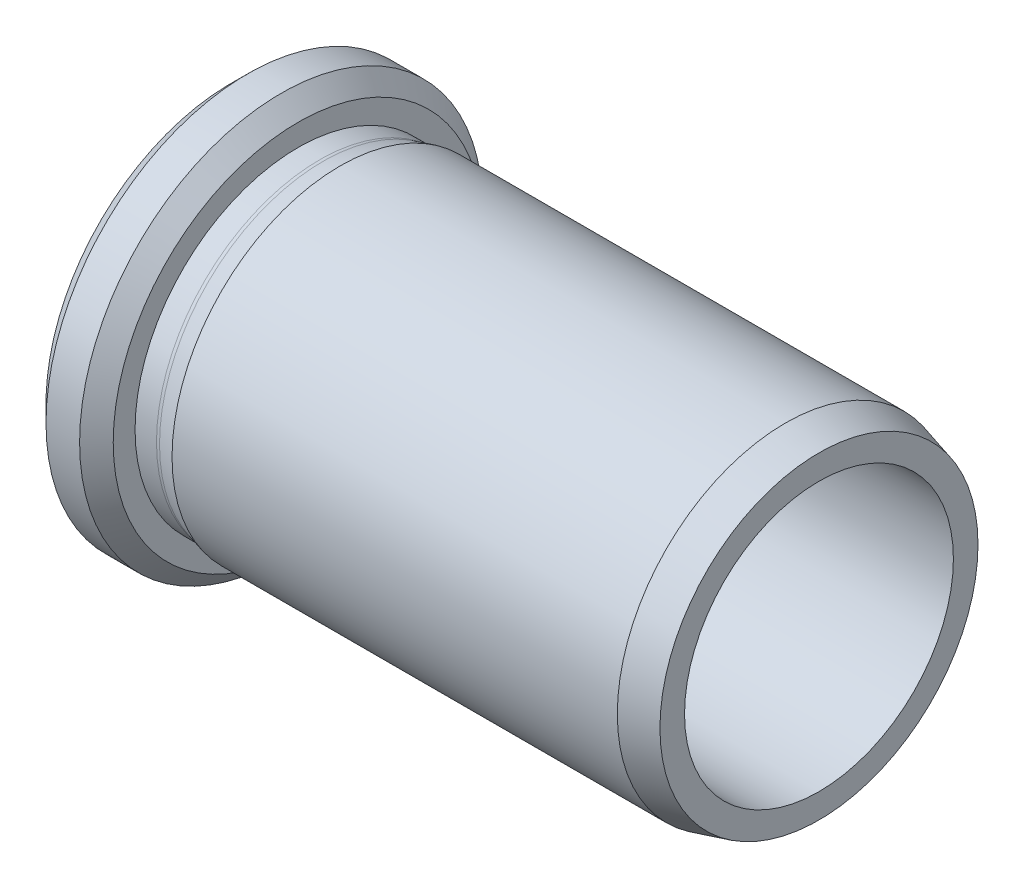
ISO-10303-21;
HEADER;
FILE_DESCRIPTION(('STEP AP214'),'2;1');
FILE_NAME('part.step','',(''),(''),'','','');
FILE_SCHEMA(('AUTOMOTIVE_DESIGN { 1 0 10303 214 1 1 1 1 }'));
ENDSEC;
DATA;
#1=APPLICATION_CONTEXT('core data for automotive mechanical design processes');
#2=APPLICATION_PROTOCOL_DEFINITION('international standard','automotive_design',2000,#1);
#3=PRODUCT_CONTEXT('',#1,'mechanical');
#4=PRODUCT('Part','Part','',(#3));
#5=PRODUCT_RELATED_PRODUCT_CATEGORY('part','',(#4));
#6=PRODUCT_DEFINITION_FORMATION('','',#4);
#7=PRODUCT_DEFINITION_CONTEXT('part definition',#1,'design');
#8=PRODUCT_DEFINITION('design','',#6,#7);
#9=PRODUCT_DEFINITION_SHAPE('','',#8);
#10=(LENGTH_UNIT() NAMED_UNIT(*) SI_UNIT(.MILLI.,.METRE.));
#11=(NAMED_UNIT(*) PLANE_ANGLE_UNIT() SI_UNIT($,.RADIAN.));
#12=(NAMED_UNIT(*) SI_UNIT($,.STERADIAN.) SOLID_ANGLE_UNIT());
#13=UNCERTAINTY_MEASURE_WITH_UNIT(LENGTH_MEASURE(1.E-05),#10,'distance_accuracy_value','');
#14=(GEOMETRIC_REPRESENTATION_CONTEXT(3) GLOBAL_UNCERTAINTY_ASSIGNED_CONTEXT((#13)) GLOBAL_UNIT_ASSIGNED_CONTEXT((#10,
#11,#12)) REPRESENTATION_CONTEXT('',''));
#15=CARTESIAN_POINT('',(0.,0.,0.));
#16=DIRECTION('',(0.,0.,1.));
#17=DIRECTION('',(1.,0.,0.));
#18=AXIS2_PLACEMENT_3D('',#15,#16,#17);
#19=CARTESIAN_POINT('',(16.075539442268,0.,0.));
#20=DIRECTION('',(-1.,0.,0.));
#21=DIRECTION('',(0.,0.,1.));
#22=AXIS2_PLACEMENT_3D('',#19,#20,#21);
#23=TOROIDAL_SURFACE('',#22,10.5,0.8);
#24=CARTESIAN_POINT('',(16.075539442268,0.,0.));
#25=DIRECTION('',(-1.,0.,0.));
#26=DIRECTION('',(0.,0.,1.));
#27=AXIS2_PLACEMENT_3D('',#24,#25,#26);
#28=CIRCLE('',#27,9.7);
#29=CARTESIAN_POINT('',(16.075539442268,0.,9.7));
#30=VERTEX_POINT('',#29);
#31=EDGE_CURVE('E58',#30,#30,#28,.T.);
#32=ORIENTED_EDGE('',*,*,#31,.F.);
#33=EDGE_LOOP('',(#32));
#34=FACE_BOUND('',#33,.T.);
#35=CARTESIAN_POINT('',(16.2825946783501,0.,0.));
#36=DIRECTION('',(-1.,0.,0.));
#37=DIRECTION('',(0.,0.,1.));
#38=AXIS2_PLACEMENT_3D('',#35,#36,#37);
#39=CIRCLE('',#38,9.72725933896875);
#40=CARTESIAN_POINT('',(16.2825946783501,0.,9.72725933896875));
#41=VERTEX_POINT('',#40);
#42=EDGE_CURVE('E40',#41,#41,#39,.T.);
#43=ORIENTED_EDGE('',*,*,#42,.T.);
#44=EDGE_LOOP('',(#43));
#45=FACE_BOUND('',#44,.T.);
#46=ADVANCED_FACE('F14',(#34,#45),#23,.F.);
#47=CARTESIAN_POINT('',(17.3004766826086,0.,0.));
#48=DIRECTION('',(1.,0.,0.));
#49=DIRECTION('',(0.,0.,-1.));
#50=AXIS2_PLACEMENT_3D('',#47,#48,#49);
#51=CONICAL_SURFACE('',#50,10.,0.261799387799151);
#52=ORIENTED_EDGE('',*,*,#42,.F.);
#53=EDGE_LOOP('',(#52));
#54=FACE_BOUND('',#53,.T.);
#55=CARTESIAN_POINT('',(17.3004766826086,0.,0.));
#56=DIRECTION('',(-1.,0.,0.));
#57=DIRECTION('',(0.,0.,1.));
#58=AXIS2_PLACEMENT_3D('',#55,#56,#57);
#59=CIRCLE('',#58,10.);
#60=CARTESIAN_POINT('',(17.3004766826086,0.,10.));
#61=VERTEX_POINT('',#60);
#62=EDGE_CURVE('E43',#61,#61,#59,.T.);
#63=ORIENTED_EDGE('',*,*,#62,.T.);
#64=EDGE_LOOP('',(#63));
#65=FACE_BOUND('',#64,.T.);
#66=ADVANCED_FACE('F66',(#54,#65),#51,.T.);
#67=CARTESIAN_POINT('',(0.,0.,0.));
#68=DIRECTION('',(-1.,0.,0.));
#69=DIRECTION('',(0.,0.,1.));
#70=AXIS2_PLACEMENT_3D('',#67,#68,#69);
#71=CYLINDRICAL_SURFACE('',#70,10.);
#72=ORIENTED_EDGE('',*,*,#62,.F.);
#73=EDGE_LOOP('',(#72));
#74=FACE_BOUND('',#73,.T.);
#75=CARTESIAN_POINT('',(43.8004766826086,0.,0.));
#76=DIRECTION('',(-1.,0.,0.));
#77=DIRECTION('',(0.,0.,1.));
#78=AXIS2_PLACEMENT_3D('',#75,#76,#77);
#79=CIRCLE('',#78,10.);
#80=CARTESIAN_POINT('',(43.8004766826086,0.,10.));
#81=VERTEX_POINT('',#80);
#82=EDGE_CURVE('E46',#81,#81,#79,.T.);
#83=ORIENTED_EDGE('',*,*,#82,.T.);
#84=EDGE_LOOP('',(#83));
#85=FACE_BOUND('',#84,.T.);
#86=ADVANCED_FACE('F72',(#74,#85),#71,.T.);
#87=CARTESIAN_POINT('',(45.8004766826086,0.,0.));
#88=DIRECTION('',(-1.,0.,0.));
#89=DIRECTION('',(0.,0.,1.));
#90=AXIS2_PLACEMENT_3D('',#87,#88,#89);
#91=CONICAL_SURFACE('',#90,9.46410161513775,0.26179938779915);
#92=ORIENTED_EDGE('',*,*,#82,.F.);
#93=EDGE_LOOP('',(#92));
#94=FACE_BOUND('',#93,.T.);
#95=CARTESIAN_POINT('',(45.8004766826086,0.,0.));
#96=DIRECTION('',(-1.,0.,0.));
#97=DIRECTION('',(0.,0.,1.));
#98=AXIS2_PLACEMENT_3D('',#95,#96,#97);
#99=CIRCLE('',#98,9.46410161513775);
#100=CARTESIAN_POINT('',(45.8004766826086,0.,9.46410161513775));
#101=VERTEX_POINT('',#100);
#102=EDGE_CURVE('E49',#101,#101,#99,.T.);
#103=ORIENTED_EDGE('',*,*,#102,.T.);
#104=EDGE_LOOP('',(#103));
#105=FACE_BOUND('',#104,.T.);
#106=ADVANCED_FACE('F78',(#94,#105),#91,.T.);
#107=CARTESIAN_POINT('',(45.8004766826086,9.46410161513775,0.));
#108=DIRECTION('',(-1.,0.,0.));
#109=DIRECTION('',(0.,0.,1.));
#110=AXIS2_PLACEMENT_3D('',#107,#108,#109);
#111=PLANE('',#110);
#112=ORIENTED_EDGE('',*,*,#102,.F.);
#113=EDGE_LOOP('',(#112));
#114=FACE_BOUND('',#113,.T.);
#115=CARTESIAN_POINT('',(45.8004766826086,0.,0.));
#116=DIRECTION('',(-1.,0.,0.));
#117=DIRECTION('',(0.,0.,1.));
#118=AXIS2_PLACEMENT_3D('',#115,#116,#117);
#119=CIRCLE('',#118,8.);
#120=CARTESIAN_POINT('',(45.8004766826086,0.,8.));
#121=VERTEX_POINT('',#120);
#122=EDGE_CURVE('E52',#121,#121,#119,.T.);
#123=ORIENTED_EDGE('',*,*,#122,.T.);
#124=EDGE_LOOP('',(#123));
#125=FACE_BOUND('',#124,.T.);
#126=ADVANCED_FACE('F84',(#114,#125),#111,.F.);
#127=CARTESIAN_POINT('',(0.,0.,0.));
#128=DIRECTION('',(-1.,0.,0.));
#129=DIRECTION('',(0.,0.,1.));
#130=AXIS2_PLACEMENT_3D('',#127,#128,#129);
#131=CYLINDRICAL_SURFACE('',#130,8.);
#132=CARTESIAN_POINT('',(12.3004766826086,0.,0.));
#133=DIRECTION('',(1.,0.,0.));
#134=DIRECTION('',(0.,0.,-1.));
#135=AXIS2_PLACEMENT_3D('',#132,#133,#134);
#136=CIRCLE('',#135,8.);
#137=CARTESIAN_POINT('',(12.3004766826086,0.,-8.));
#138=VERTEX_POINT('',#137);
#139=EDGE_CURVE('E29',#138,#138,#136,.F.);
#140=ORIENTED_EDGE('',*,*,#139,.T.);
#141=EDGE_LOOP('',(#140));
#142=FACE_BOUND('',#141,.T.);
#143=ORIENTED_EDGE('',*,*,#122,.F.);
#144=EDGE_LOOP('',(#143));
#145=FACE_BOUND('',#144,.T.);
#146=ADVANCED_FACE('F90',(#142,#145),#131,.F.);
#147=CARTESIAN_POINT('',(10.8004766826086,12.,0.));
#148=DIRECTION('',(1.,0.,0.));
#149=DIRECTION('',(0.,0.,-1.));
#150=AXIS2_PLACEMENT_3D('',#147,#148,#149);
#151=PLANE('',#150);
#152=CARTESIAN_POINT('',(10.8004766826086,0.,0.));
#153=DIRECTION('',(1.,0.,0.));
#154=DIRECTION('',(0.,0.,-1.));
#155=AXIS2_PLACEMENT_3D('',#152,#153,#154);
#156=CIRCLE('',#155,9.5);
#157=CARTESIAN_POINT('',(10.8004766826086,0.,-9.5));
#158=VERTEX_POINT('',#157);
#159=EDGE_CURVE('E25',#158,#158,#156,.T.);
#160=ORIENTED_EDGE('',*,*,#159,.T.);
#161=EDGE_LOOP('',(#160));
#162=FACE_BOUND('',#161,.T.);
#163=CARTESIAN_POINT('',(10.8004766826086,0.,0.));
#164=DIRECTION('',(1.,0.,0.));
#165=DIRECTION('',(0.,0.,-1.));
#166=AXIS2_PLACEMENT_3D('',#163,#164,#165);
#167=CIRCLE('',#166,11.);
#168=CARTESIAN_POINT('',(10.8004766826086,0.,-11.));
#169=VERTEX_POINT('',#168);
#170=EDGE_CURVE('E37',#169,#169,#167,.F.);
#171=ORIENTED_EDGE('',*,*,#170,.T.);
#172=EDGE_LOOP('',(#171));
#173=FACE_BOUND('',#172,.T.);
#174=ADVANCED_FACE('F95',(#162,#173),#151,.F.);
#175=CARTESIAN_POINT('',(0.,0.,0.));
#176=DIRECTION('',(-1.,0.,0.));
#177=DIRECTION('',(0.,0.,1.));
#178=AXIS2_PLACEMENT_3D('',#175,#176,#177);
#179=CYLINDRICAL_SURFACE('',#178,12.);
#180=CARTESIAN_POINT('',(13.8004766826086,0.,0.));
#181=DIRECTION('',(-1.,0.,0.));
#182=DIRECTION('',(0.,0.,1.));
#183=AXIS2_PLACEMENT_3D('',#180,#181,#182);
#184=CIRCLE('',#183,12.);
#185=CARTESIAN_POINT('',(13.8004766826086,0.,12.));
#186=VERTEX_POINT('',#185);
#187=EDGE_CURVE('E21',#186,#186,#184,.T.);
#188=ORIENTED_EDGE('',*,*,#187,.T.);
#189=EDGE_LOOP('',(#188));
#190=FACE_BOUND('',#189,.T.);
#191=CARTESIAN_POINT('',(11.8004766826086,0.,0.));
#192=DIRECTION('',(1.,0.,0.));
#193=DIRECTION('',(0.,0.,-1.));
#194=AXIS2_PLACEMENT_3D('',#191,#192,#193);
#195=CIRCLE('',#194,12.);
#196=CARTESIAN_POINT('',(11.8004766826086,0.,-12.));
#197=VERTEX_POINT('',#196);
#198=EDGE_CURVE('E34',#197,#197,#195,.T.);
#199=ORIENTED_EDGE('',*,*,#198,.T.);
#200=EDGE_LOOP('',(#199));
#201=FACE_BOUND('',#200,.T.);
#202=ADVANCED_FACE('F103',(#190,#201),#179,.T.);
#203=CARTESIAN_POINT('',(14.8004766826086,12.,0.));
#204=DIRECTION('',(-1.,0.,0.));
#205=DIRECTION('',(0.,0.,1.));
#206=AXIS2_PLACEMENT_3D('',#203,#204,#205);
#207=PLANE('',#206);
#208=CARTESIAN_POINT('',(14.8004766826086,0.,0.));
#209=DIRECTION('',(-1.,0.,0.));
#210=DIRECTION('',(0.,0.,1.));
#211=AXIS2_PLACEMENT_3D('',#208,#209,#210);
#212=CIRCLE('',#211,11.);
#213=CARTESIAN_POINT('',(14.8004766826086,0.,11.));
#214=VERTEX_POINT('',#213);
#215=EDGE_CURVE('E9',#214,#214,#212,.F.);
#216=ORIENTED_EDGE('',*,*,#215,.T.);
#217=EDGE_LOOP('',(#216));
#218=FACE_BOUND('',#217,.T.);
#219=CARTESIAN_POINT('',(14.8004766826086,0.,0.));
#220=DIRECTION('',(-1.,0.,0.));
#221=DIRECTION('',(0.,0.,1.));
#222=AXIS2_PLACEMENT_3D('',#219,#220,#221);
#223=CIRCLE('',#222,9.7);
#224=CARTESIAN_POINT('',(14.8004766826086,0.,9.7));
#225=VERTEX_POINT('',#224);
#226=EDGE_CURVE('E55',#225,#225,#223,.T.);
#227=ORIENTED_EDGE('',*,*,#226,.T.);
#228=EDGE_LOOP('',(#227));
#229=FACE_BOUND('',#228,.T.);
#230=ADVANCED_FACE('F142',(#218,#229),#207,.F.);
#231=CARTESIAN_POINT('',(0.,0.,0.));
#232=DIRECTION('',(-1.,0.,0.));
#233=DIRECTION('',(0.,0.,1.));
#234=AXIS2_PLACEMENT_3D('',#231,#232,#233);
#235=CYLINDRICAL_SURFACE('',#234,9.7);
#236=ORIENTED_EDGE('',*,*,#226,.F.);
#237=EDGE_LOOP('',(#236));
#238=FACE_BOUND('',#237,.T.);
#239=ORIENTED_EDGE('',*,*,#31,.T.);
#240=EDGE_LOOP('',(#239));
#241=FACE_BOUND('',#240,.T.);
#242=ADVANCED_FACE('F62',(#238,#241),#235,.T.);
#243=CARTESIAN_POINT('',(10.8004766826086,0.,0.));
#244=DIRECTION('',(1.,0.,0.));
#245=DIRECTION('',(0.,0.,-1.));
#246=AXIS2_PLACEMENT_3D('',#243,#244,#245);
#247=CONICAL_SURFACE('',#246,11.,0.785398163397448);
#248=ORIENTED_EDGE('',*,*,#198,.F.);
#249=EDGE_LOOP('',(#248));
#250=FACE_BOUND('',#249,.T.);
#251=ORIENTED_EDGE('',*,*,#170,.F.);
#252=EDGE_LOOP('',(#251));
#253=FACE_BOUND('',#252,.T.);
#254=ADVANCED_FACE('F108',(#250,#253),#247,.T.);
#255=CARTESIAN_POINT('',(12.3004766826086,0.,0.));
#256=DIRECTION('',(1.,0.,0.));
#257=DIRECTION('',(0.,0.,-1.));
#258=AXIS2_PLACEMENT_3D('',#255,#256,#257);
#259=TOROIDAL_SURFACE('',#258,9.5,1.5);
#260=ORIENTED_EDGE('',*,*,#159,.F.);
#261=EDGE_LOOP('',(#260));
#262=FACE_BOUND('',#261,.T.);
#263=ORIENTED_EDGE('',*,*,#139,.F.);
#264=EDGE_LOOP('',(#263));
#265=FACE_BOUND('',#264,.T.);
#266=ADVANCED_FACE('F110',(#262,#265),#259,.T.);
#267=CARTESIAN_POINT('',(13.8004766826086,0.,0.));
#268=DIRECTION('',(-1.,0.,0.));
#269=DIRECTION('',(0.,0.,1.));
#270=AXIS2_PLACEMENT_3D('',#267,#268,#269);
#271=CONICAL_SURFACE('',#270,12.,0.785398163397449);
#272=ORIENTED_EDGE('',*,*,#215,.F.);
#273=EDGE_LOOP('',(#272));
#274=FACE_BOUND('',#273,.T.);
#275=ORIENTED_EDGE('',*,*,#187,.F.);
#276=EDGE_LOOP('',(#275));
#277=FACE_BOUND('',#276,.T.);
#278=ADVANCED_FACE('F16',(#274,#277),#271,.T.);
#279=CLOSED_SHELL('',(#46,#66,#86,#106,#126,#146,#174,#202,#230,#242,#254,#266,#278));
#280=MANIFOLD_SOLID_BREP('B1',#279);
#281=ADVANCED_BREP_SHAPE_REPRESENTATION('',(#18,#280),#14);
#282=SHAPE_DEFINITION_REPRESENTATION(#9,#281);
ENDSEC;
END-ISO-10303-21;
